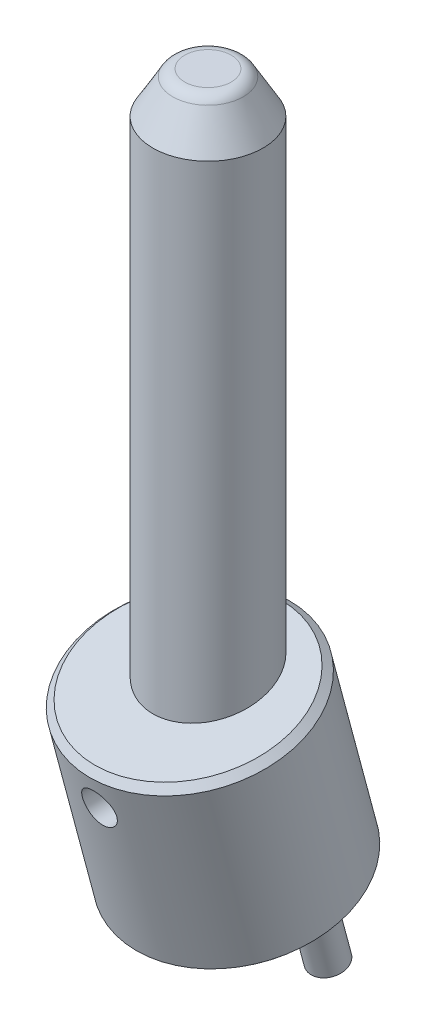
ISO-10303-21;
HEADER;
FILE_DESCRIPTION(('STEP AP214'),'2;1');
FILE_NAME('part.step','',(''),(''),'','','');
FILE_SCHEMA(('AUTOMOTIVE_DESIGN { 1 0 10303 214 1 1 1 1 }'));
ENDSEC;
DATA;
#1=APPLICATION_CONTEXT('core data for automotive mechanical design processes');
#2=APPLICATION_PROTOCOL_DEFINITION('international standard','automotive_design',2000,#1);
#3=PRODUCT_CONTEXT('',#1,'mechanical');
#4=PRODUCT('Part','Part','',(#3));
#5=PRODUCT_RELATED_PRODUCT_CATEGORY('part','',(#4));
#6=PRODUCT_DEFINITION_FORMATION('','',#4);
#7=PRODUCT_DEFINITION_CONTEXT('part definition',#1,'design');
#8=PRODUCT_DEFINITION('design','',#6,#7);
#9=PRODUCT_DEFINITION_SHAPE('','',#8);
#10=(LENGTH_UNIT() NAMED_UNIT(*) SI_UNIT(.MILLI.,.METRE.));
#11=(NAMED_UNIT(*) PLANE_ANGLE_UNIT() SI_UNIT($,.RADIAN.));
#12=(NAMED_UNIT(*) SI_UNIT($,.STERADIAN.) SOLID_ANGLE_UNIT());
#13=UNCERTAINTY_MEASURE_WITH_UNIT(LENGTH_MEASURE(1.E-05),#10,'distance_accuracy_value','');
#14=(GEOMETRIC_REPRESENTATION_CONTEXT(3) GLOBAL_UNCERTAINTY_ASSIGNED_CONTEXT((#13)) GLOBAL_UNIT_ASSIGNED_CONTEXT((#10,
#11,#12)) REPRESENTATION_CONTEXT('',''));
#15=CARTESIAN_POINT('',(0.,0.,0.));
#16=DIRECTION('',(0.,0.,1.));
#17=DIRECTION('',(1.,0.,0.));
#18=AXIS2_PLACEMENT_3D('',#15,#16,#17);
#19=CARTESIAN_POINT('',(0.,99.,0.));
#20=DIRECTION('',(0.,1.,0.));
#21=DIRECTION('',(-1.,0.,0.));
#22=AXIS2_PLACEMENT_3D('',#19,#20,#21);
#23=PLANE('',#22);
#24=CARTESIAN_POINT('',(0.,99.,-3.381197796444));
#25=CARTESIAN_POINT('',(0.0491775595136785,99.,-3.38119852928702));
#26=CARTESIAN_POINT('',(0.0983550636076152,99.,-3.38012493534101));
#27=CARTESIAN_POINT('',(0.196616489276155,99.,-3.37583435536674));
#28=CARTESIAN_POINT('',(0.245700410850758,99.,-3.37261736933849));
#29=CARTESIAN_POINT('',(0.343681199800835,99.,-3.36404526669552));
#30=CARTESIAN_POINT('',(0.392578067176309,99.,-3.35869015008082));
#31=CARTESIAN_POINT('',(0.490091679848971,99.,-3.3458522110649));
#32=CARTESIAN_POINT('',(0.53870842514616,99.,-3.33836938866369));
#33=CARTESIAN_POINT('',(0.635569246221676,99.,-3.321290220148));
#34=CARTESIAN_POINT('',(0.683813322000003,99.,-3.31169387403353));
#35=CARTESIAN_POINT('',(0.77983696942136,99.,-3.29040594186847));
#36=CARTESIAN_POINT('',(0.82761654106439,99.,-3.27871435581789));
#37=CARTESIAN_POINT('',(0.922620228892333,99.,-3.25325819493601));
#38=CARTESIAN_POINT('',(0.969844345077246,99.,-3.23949362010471));
#39=CARTESIAN_POINT('',(1.06364722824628,99.,-3.20991768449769));
#40=CARTESIAN_POINT('',(1.11022599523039,99.,-3.19410632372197));
#41=CARTESIAN_POINT('',(1.202649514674,99.,-3.16046691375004));
#42=CARTESIAN_POINT('',(1.24849426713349,99.,-3.14263886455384));
#43=CARTESIAN_POINT('',(1.33936248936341,99.,-3.10500001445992));
#44=CARTESIAN_POINT('',(1.38438595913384,99.,-3.08518921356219));
#45=CARTESIAN_POINT('',(1.47352591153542,99.,-3.04362257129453));
#46=CARTESIAN_POINT('',(1.51764239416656,99.,-3.02186672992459));
#47=CARTESIAN_POINT('',(1.60488439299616,99.,-2.97645141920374));
#48=CARTESIAN_POINT('',(1.64800990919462,99.,-2.95279194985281));
#49=CARTESIAN_POINT('',(1.73318788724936,99.,-2.90361442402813));
#50=CARTESIAN_POINT('',(1.77524034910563,99.,-2.87809636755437));
#51=CARTESIAN_POINT('',(1.85819215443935,99.,-2.82525022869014));
#52=CARTESIAN_POINT('',(1.89909149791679,98.9999999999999,-2.79792214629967));
#53=CARTESIAN_POINT('',(1.9796592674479,99.0000000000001,-2.74150802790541));
#54=CARTESIAN_POINT('',(2.01932769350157,99.0000000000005,-2.71242199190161));
#55=CARTESIAN_POINT('',(2.09735791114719,98.9999999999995,-2.65254714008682));
#56=CARTESIAN_POINT('',(2.13571970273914,98.9999999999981,-2.62175832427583));
#57=CARTESIAN_POINT('',(2.21106439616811,99.0000000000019,-2.55853724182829));
#58=CARTESIAN_POINT('',(2.24804729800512,99.000000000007,-2.52610497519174));
#59=CARTESIAN_POINT('',(2.32056094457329,98.9999999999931,-2.45965603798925));
#60=CARTESIAN_POINT('',(2.35609168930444,98.999999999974,-2.42563936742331));
#61=CARTESIAN_POINT('',(2.4270521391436,99.000000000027,-2.35468855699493));
#62=CARTESIAN_POINT('',(2.46241950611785,99.0000000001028,-2.3176920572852));
#63=CARTESIAN_POINT('',(2.53146011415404,98.9999999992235,-2.2421494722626));
#64=CARTESIAN_POINT('',(2.56513332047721,98.9999999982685,-2.20360335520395));
#65=CARTESIAN_POINT('',(2.63071590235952,98.9999999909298,-2.12503640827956));
#66=CARTESIAN_POINT('',(2.66262520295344,98.9999999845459,-2.08501551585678));
#67=CARTESIAN_POINT('',(2.72461562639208,98.9999999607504,-2.00357584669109));
#68=CARTESIAN_POINT('',(2.75469663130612,98.9999999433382,-1.962156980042));
#69=CARTESIAN_POINT('',(2.79840512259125,98.9999998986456,-1.89905244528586));
#70=CARTESIAN_POINT('',(2.81273996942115,98.9999998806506,-1.87785353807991));
#71=CARTESIAN_POINT('',(2.84090935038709,98.9999998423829,-1.83514783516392));
#72=CARTESIAN_POINT('',(2.85474423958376,98.9999998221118,-1.81364127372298));
#73=CARTESIAN_POINT('',(2.89548728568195,98.9999997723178,-1.74864245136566));
#74=CARTESIAN_POINT('',(2.92163476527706,98.9999997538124,-1.70466969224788));
#75=CARTESIAN_POINT('',(2.97183520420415,98.9999997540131,-1.61554840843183));
#76=CARTESIAN_POINT('',(2.99588817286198,98.9999997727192,-1.57039988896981));
#77=CARTESIAN_POINT('',(3.04188860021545,98.9999998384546,-1.47904330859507));
#78=CARTESIAN_POINT('',(3.06383620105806,98.999999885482,-1.43283531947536));
#79=CARTESIAN_POINT('',(3.10541271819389,98.9999999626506,-1.33939702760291));
#80=CARTESIAN_POINT('',(3.12504193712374,98.999999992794,-1.29216685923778));
#81=CARTESIAN_POINT('',(3.15291976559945,99.0000000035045,-1.22146858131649));
#82=CARTESIAN_POINT('',(3.1618349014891,99.000000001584,-1.1982567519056));
#83=CARTESIAN_POINT('',(3.19901993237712,98.9999999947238,-1.09818755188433));
#84=CARTESIAN_POINT('',(3.22479363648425,98.9999999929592,-1.02037068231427));
#85=CARTESIAN_POINT('',(3.25883872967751,98.999999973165,-0.903503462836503));
#86=CARTESIAN_POINT('',(3.26930037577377,98.999999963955,-0.865070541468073));
#87=CARTESIAN_POINT('',(3.29035807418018,98.9999999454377,-0.78187483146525));
#88=CARTESIAN_POINT('',(3.30072437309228,98.9999999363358,-0.737052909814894));
#89=CARTESIAN_POINT('',(3.31424558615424,98.9999999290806,-0.672514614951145));
#90=CARTESIAN_POINT('',(3.31816009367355,98.999999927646,-0.652953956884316));
#91=CARTESIAN_POINT('',(3.32632060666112,98.9999999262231,-0.610180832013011));
#92=CARTESIAN_POINT('',(3.33049626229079,98.9999999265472,-0.586954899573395));
#93=CARTESIAN_POINT('',(3.34228609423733,98.9999999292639,-0.517153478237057));
#94=CARTESIAN_POINT('',(3.34916375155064,98.9999999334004,-0.470451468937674));
#95=CARTESIAN_POINT('',(3.36093725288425,98.9999999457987,-0.37680095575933));
#96=CARTESIAN_POINT('',(3.36583314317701,98.9999999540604,-0.329852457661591));
#97=CARTESIAN_POINT('',(3.37363895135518,98.999999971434,-0.235792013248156));
#98=CARTESIAN_POINT('',(3.37654894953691,98.9999999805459,-0.188680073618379));
#99=CARTESIAN_POINT('',(3.38036477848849,98.9999999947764,-0.0943781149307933));
#100=CARTESIAN_POINT('',(3.381270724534,98.9999999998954,-0.0471881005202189));
#101=CARTESIAN_POINT('',(3.38112481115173,99.0000000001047,0.0472251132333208));
#102=CARTESIAN_POINT('',(3.38007141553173,98.9999999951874,0.09444830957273));
#103=CARTESIAN_POINT('',(3.37605062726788,98.9999999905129,0.188811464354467));
#104=CARTESIAN_POINT('',(3.37308329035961,98.9999999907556,0.2359514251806));
#105=CARTESIAN_POINT('',(3.36523468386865,98.9999999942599,0.330073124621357));
#106=CARTESIAN_POINT('',(3.36035337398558,98.9999999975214,0.377054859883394));
#107=CARTESIAN_POINT('',(3.34865879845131,99.0000000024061,0.47078071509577));
#108=CARTESIAN_POINT('',(3.34184539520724,99.000000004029,0.517524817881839));
#109=CARTESIAN_POINT('',(3.33026552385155,98.9999999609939,0.587415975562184));
#110=CARTESIAN_POINT('',(3.3261786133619,98.9999999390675,0.610677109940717));
#111=CARTESIAN_POINT('',(3.32001382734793,98.9999999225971,0.643328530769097));
#112=CARTESIAN_POINT('',(3.31818160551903,98.9999999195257,0.652765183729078));
#113=CARTESIAN_POINT('',(3.30790809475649,98.999999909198,0.704387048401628));
#114=CARTESIAN_POINT('',(3.29862776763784,98.999999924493,0.746407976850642));
#115=CARTESIAN_POINT('',(3.27611885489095,98.9999999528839,0.839847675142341));
#116=CARTESIAN_POINT('',(3.26247449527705,98.9999999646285,0.891165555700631));
#117=CARTESIAN_POINT('',(3.22698341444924,98.9999999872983,1.01297067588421));
#118=CARTESIAN_POINT('',(3.20401224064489,98.9999999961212,1.0831356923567));
#119=CARTESIAN_POINT('',(3.16757440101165,99.0000000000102,1.18334600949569));
#120=CARTESIAN_POINT('',(3.15590283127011,98.9999999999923,1.21405838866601));
#121=CARTESIAN_POINT('',(3.12494638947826,99.000000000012,1.2921679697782));
#122=CARTESIAN_POINT('',(3.10504413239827,99.0000000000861,1.33932320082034));
#123=CARTESIAN_POINT('',(3.06313614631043,98.9999999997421,1.43268851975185));
#124=CARTESIAN_POINT('',(3.04113038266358,98.9999999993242,1.47889859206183));
#125=CARTESIAN_POINT('',(2.9950713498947,98.9999999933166,1.57028914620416));
#126=CARTESIAN_POINT('',(2.97101799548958,98.9999999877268,1.61546958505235));
#127=CARTESIAN_POINT('',(2.92090425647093,98.9999999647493,1.7047092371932));
#128=CARTESIAN_POINT('',(2.89484373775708,98.9999999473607,1.74876837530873));
#129=CARTESIAN_POINT('',(2.85429856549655,98.9999999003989,1.81395013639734));
#130=CARTESIAN_POINT('',(2.84054017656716,98.9999998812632,1.83552759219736));
#131=CARTESIAN_POINT('',(2.81254197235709,98.9999998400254,1.87834577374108));
#132=CARTESIAN_POINT('',(2.7983025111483,98.9999998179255,1.89958673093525));
#133=CARTESIAN_POINT('',(2.75484041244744,98.9999997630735,1.96280026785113));
#134=CARTESIAN_POINT('',(2.72487327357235,98.9999997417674,2.00426478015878));
#135=CARTESIAN_POINT('',(2.6630249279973,98.999999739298,2.08573639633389));
#136=CARTESIAN_POINT('',(2.63114372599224,98.9999997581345,2.12574350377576));
#137=CARTESIAN_POINT('',(2.56557045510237,98.999999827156,2.20424440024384));
#138=CARTESIAN_POINT('',(2.53187851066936,98.9999998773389,2.24273829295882));
#139=CARTESIAN_POINT('',(2.46263073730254,98.9999999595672,2.31799882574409));
#140=CARTESIAN_POINT('',(2.42707516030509,98.9999999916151,2.35476569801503));
#141=CARTESIAN_POINT('',(2.37140677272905,99.0000000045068,2.41027252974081));
#142=CARTESIAN_POINT('',(2.35175738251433,99.0000000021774,2.42948514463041));
#143=CARTESIAN_POINT('',(2.26802085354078,98.9999999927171,2.50941121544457));
#144=CARTESIAN_POINT('',(2.20177871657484,98.9999999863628,2.56792039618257));
#145=CARTESIAN_POINT('',(2.10003782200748,98.9999999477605,2.65091291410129));
#146=CARTESIAN_POINT('',(2.06619123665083,98.9999999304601,2.67746023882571));
#147=CARTESIAN_POINT('',(1.99205588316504,98.9999998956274,2.7333276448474));
#148=CARTESIAN_POINT('',(1.95159525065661,98.9999998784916,2.76242170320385));
#149=CARTESIAN_POINT('',(1.89261855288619,98.9999998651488,2.80284359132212));
#150=CARTESIAN_POINT('',(1.87461413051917,98.9999998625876,2.81492542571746));
#151=CARTESIAN_POINT('',(1.83512217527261,98.9999998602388,2.84086885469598));
#152=CARTESIAN_POINT('',(1.81358901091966,98.9999998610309,2.85466108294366));
#153=CARTESIAN_POINT('',(1.74852510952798,98.9999998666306,2.89529180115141));
#154=CARTESIAN_POINT('',(1.70452676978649,98.999999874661,2.92138652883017));
#155=CARTESIAN_POINT('',(1.61538183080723,98.9999998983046,2.97152713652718));
#156=CARTESIAN_POINT('',(1.57023526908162,98.9999999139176,2.99557308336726));
#157=CARTESIAN_POINT('',(1.47889045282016,98.9999999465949,3.04157160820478));
#158=CARTESIAN_POINT('',(1.43269225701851,98.9999999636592,3.0635243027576));
#159=CARTESIAN_POINT('',(1.33933611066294,98.9999999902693,3.10527343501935));
#160=CARTESIAN_POINT('',(1.29217823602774,98.9999999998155,3.12507004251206));
#161=CARTESIAN_POINT('',(1.20065831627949,99.0000000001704,3.16109559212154));
#162=CARTESIAN_POINT('',(1.15635789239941,98.9999999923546,3.17748154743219));
#163=CARTESIAN_POINT('',(1.06713504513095,98.9999999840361,3.20845589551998));
#164=CARTESIAN_POINT('',(1.02221264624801,98.999999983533,3.22304435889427));
#165=CARTESIAN_POINT('',(0.931813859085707,98.9999999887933,3.25039463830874));
#166=CARTESIAN_POINT('',(0.886337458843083,98.9999999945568,3.26315641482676));
#167=CARTESIAN_POINT('',(0.794895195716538,99.0000000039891,3.28680491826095));
#168=CARTESIAN_POINT('',(0.74892929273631,99.0000000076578,3.29769149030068));
#169=CARTESIAN_POINT('',(0.686121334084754,98.9999999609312,3.31129818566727));
#170=CARTESIAN_POINT('',(0.669443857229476,98.9999999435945,3.31479031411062));
#171=CARTESIAN_POINT('',(0.639370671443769,98.9999999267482,3.32077892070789));
#172=CARTESIAN_POINT('',(0.625986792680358,98.9999999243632,3.32333471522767));
#173=CARTESIAN_POINT('',(0.564781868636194,98.9999999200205,3.33461824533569));
#174=CARTESIAN_POINT('',(0.516772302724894,98.9999999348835,3.34234416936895));
#175=CARTESIAN_POINT('',(0.428809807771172,98.9999999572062,3.35455837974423));
#176=CARTESIAN_POINT('',(0.388901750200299,98.9999999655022,3.35937566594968));
#177=CARTESIAN_POINT('',(0.315880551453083,98.9999999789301,3.36686744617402));
#178=CARTESIAN_POINT('',(0.28279046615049,98.9999999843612,3.36976874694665));
#179=CARTESIAN_POINT('',(0.198641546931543,98.9999999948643,3.37590123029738));
#180=CARTESIAN_POINT('',(0.147531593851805,98.9999999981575,3.37846406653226));
#181=CARTESIAN_POINT('',(0.0775593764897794,98.9999999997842,3.38039422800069));
#182=CARTESIAN_POINT('',(0.0587195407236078,98.9999999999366,3.38075747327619));
#183=CARTESIAN_POINT('',(0.0265859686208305,99.0000000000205,3.38112029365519));
#184=CARTESIAN_POINT('',(0.0132930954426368,99.0000000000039,3.38119547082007));
#185=CARTESIAN_POINT('',(0.,99.,3.381197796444));
#186=B_SPLINE_CURVE_WITH_KNOTS('',3,(#24,#25,#26,#27,#28,#29,#30,#31,#32,#33,#34,#35,#36,#37,
#38,#39,#40,#41,#42,#43,#44,#45,#46,#47,#48,#49,#50,#51,#52,#53,#54,#55,#56,#57,#58,#59,#60,#61,
#62,#63,#64,#65,#66,#67,#68,#69,#70,#71,#72,#73,#74,#75,#76,#77,#78,#79,#80,#81,#82,#83,#84,#85,
#86,#87,#88,#89,#90,#91,#92,#93,#94,#95,#96,#97,#98,#99,#100,#101,#102,#103,#104,#105,#106,#107,
#108,#109,#110,#111,#112,#113,#114,#115,#116,#117,#118,#119,#120,#121,#122,#123,#124,#125,#126,
#127,#128,#129,#130,#131,#132,#133,#134,#135,#136,#137,#138,#139,#140,#141,#142,#143,#144,#145,
#146,#147,#148,#149,#150,#151,#152,#153,#154,#155,#156,#157,#158,#159,#160,#161,#162,#163,#164,
#165,#166,#167,#168,#169,#170,#171,#172,#173,#174,#175,#176,#177,#178,#179,#180,#181,#182,#183,
#184,#185),.UNSPECIFIED.,.F.,.F.,(4,2,2,2,2,2,2,2,2,2,2,2,2,2,2,2,2,2,2,2,2,2,2,2,2,2,2,2,2,2,2,
2,2,2,2,2,2,2,2,2,2,2,2,2,2,2,2,2,2,2,2,2,2,2,2,2,2,2,2,2,2,2,2,2,2,2,2,2,2,2,2,2,2,2,2,2,2,2,2,
2,4),(0.,0.147520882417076,0.295041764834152,0.442562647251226,0.590083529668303,
0.737604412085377,0.885125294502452,1.03264617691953,1.18016705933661,1.32768794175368,
1.47520882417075,1.62272970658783,1.77025058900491,1.91777147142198,2.06529235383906,
2.21281323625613,2.36033411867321,2.50785500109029,2.65537588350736,2.80886971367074,
2.96236668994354,3.11587018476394,3.26938357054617,3.34614986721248,3.42286052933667,
3.57627689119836,3.72969256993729,3.88309788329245,4.03648314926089,4.11107818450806,
4.35672731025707,4.47620511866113,4.61417295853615,4.67401611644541,4.7448062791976,
4.88637772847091,5.02794587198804,5.16950829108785,5.31106256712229,5.45272787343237,
5.59438905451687,5.73605321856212,5.87772747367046,5.94857428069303,5.9774125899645,
6.106474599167,6.26572562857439,6.48702972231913,6.58558754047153,6.73908101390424,
6.89257701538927,7.04607941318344,7.19959207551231,7.27635829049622,7.3530691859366,
7.50648650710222,7.65990345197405,7.81330986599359,7.96669559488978,8.04913919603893,
8.3139440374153,8.4429705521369,8.59241517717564,8.65745956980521,8.73416806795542,
8.88757343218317,9.04097379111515,9.19436560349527,9.34774532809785,9.48940809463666,
9.6310652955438,9.77272556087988,9.91439752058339,9.9655130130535,10.006389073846,
10.152216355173,10.2727850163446,10.3724238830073,10.5258841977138,10.5824125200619,
10.6222911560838),.UNSPECIFIED.);
#187=CARTESIAN_POINT('',(0.,99.,-3.3811978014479));
#188=VERTEX_POINT('',#187);
#189=CARTESIAN_POINT('',(0.,99.,3.3811978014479));
#190=VERTEX_POINT('',#189);
#191=EDGE_CURVE('P0_E38',#188,#190,#186,.T.);
#192=ORIENTED_EDGE('',*,*,#191,.F.);
#193=CARTESIAN_POINT('',(0.,99.,0.));
#194=DIRECTION('',(0.,-1.,0.));
#195=DIRECTION('',(0.,0.,1.));
#196=AXIS2_PLACEMENT_3D('',#193,#194,#195);
#197=CIRCLE('',#196,3.381197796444);
#198=EDGE_CURVE('P0_E42',#190,#188,#197,.T.);
#199=ORIENTED_EDGE('',*,*,#198,.F.);
#200=EDGE_LOOP('',(#192,#199));
#201=FACE_BOUND('',#200,.T.);
#202=ADVANCED_FACE('P0_F17',(#201),#23,.T.);
#203=CARTESIAN_POINT('',(0.,97.,0.));
#204=DIRECTION('',(0.,1.,0.));
#205=DIRECTION('',(0.0117940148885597,0.,0.999930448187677));
#206=AXIS2_PLACEMENT_3D('',#203,#204,#205);
#207=TOROIDAL_SURFACE('',#206,3.381197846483,2.);
#208=ORIENTED_EDGE('',*,*,#191,.T.);
#209=ORIENTED_EDGE('',*,*,#198,.T.);
#210=EDGE_LOOP('',(#208,#209));
#211=FACE_BOUND('',#210,.T.);
#212=CARTESIAN_POINT('',(0.,98.0000000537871,0.));
#213=DIRECTION('',(0.,-1.,0.));
#214=DIRECTION('',(0.,0.,1.));
#215=AXIS2_PLACEMENT_3D('',#212,#213,#214);
#216=CIRCLE('',#215,5.11324862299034);
#217=CARTESIAN_POINT('',(0.,98.0000000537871,5.11324862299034));
#218=VERTEX_POINT('',#217);
#219=EDGE_CURVE('P0_E48',#218,#218,#216,.T.);
#220=ORIENTED_EDGE('',*,*,#219,.F.);
#221=EDGE_LOOP('',(#220));
#222=FACE_BOUND('',#221,.T.);
#223=ADVANCED_FACE('P0_F40',(#211,#222),#207,.T.);
#224=CARTESIAN_POINT('',(0.,0.,0.));
#225=DIRECTION('',(0.,1.,0.));
#226=DIRECTION('',(-1.,0.,0.));
#227=AXIS2_PLACEMENT_3D('',#224,#225,#226);
#228=PLANE('',#227);
#229=CARTESIAN_POINT('',(0.,6.2631058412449E-07,0.));
#230=DIRECTION('',(0.,1.,0.));
#231=DIRECTION('',(-1.,0.,0.));
#232=AXIS2_PLACEMENT_3D('',#229,#230,#231);
#233=CIRCLE('',#232,6.99999848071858);
#234=CARTESIAN_POINT('',(-6.99999848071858,6.26310584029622E-07,0.));
#235=VERTEX_POINT('',#234);
#236=EDGE_CURVE('P0_E85',#235,#235,#233,.T.);
#237=ORIENTED_EDGE('',*,*,#236,.F.);
#238=EDGE_LOOP('',(#237));
#239=FACE_BOUND('',#238,.T.);
#240=ADVANCED_FACE('P0_F76',(#239),#228,.F.);
#241=CARTESIAN_POINT('',(0.,14.,2.94337567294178));
#242=DIRECTION('',(0.,0.,1.));
#243=DIRECTION('',(0.,-1.,0.));
#244=AXIS2_PLACEMENT_3D('',#241,#242,#243);
#245=CONICAL_SURFACE('',#244,2.50000000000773,1.04719755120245);
#246=CARTESIAN_POINT('',(0.,14.0000000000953,1.49999999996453));
#247=VERTEX_POINT('',#246);
#248=VERTEX_LOOP('',#247);
#249=FACE_BOUND('',#248,.T.);
#250=CARTESIAN_POINT('',(0.,14.,2.943375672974));
#251=DIRECTION('',(0.,0.,1.));
#252=DIRECTION('',(0.,-1.,0.));
#253=AXIS2_PLACEMENT_3D('',#250,#251,#252);
#254=CIRCLE('',#253,2.5);
#255=CARTESIAN_POINT('',(0.,11.5,2.943375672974));
#256=VERTEX_POINT('',#255);
#257=EDGE_CURVE('P0_E82',#256,#256,#254,.T.);
#258=ORIENTED_EDGE('',*,*,#257,.T.);
#259=EDGE_LOOP('',(#258));
#260=FACE_BOUND('',#259,.T.);
#261=ADVANCED_FACE('P0_F116',(#249,#260),#245,.F.);
#262=CARTESIAN_POINT('',(0.,93.0000000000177,0.));
#263=DIRECTION('',(0.,-1.,0.));
#264=DIRECTION('',(1.,0.,0.));
#265=AXIS2_PLACEMENT_3D('',#262,#263,#264);
#266=CONICAL_SURFACE('',#265,7.99999999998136,0.523598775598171);
#267=CARTESIAN_POINT('',(0.,93.,0.));
#268=DIRECTION('',(0.,1.,0.));
#269=DIRECTION('',(-1.,0.,0.));
#270=AXIS2_PLACEMENT_3D('',#267,#268,#269);
#271=CIRCLE('',#270,8.);
#272=CARTESIAN_POINT('',(-8.,93.,0.));
#273=VERTEX_POINT('',#272);
#274=EDGE_CURVE('P0_E92',#273,#273,#271,.F.);
#275=ORIENTED_EDGE('',*,*,#274,.F.);
#276=EDGE_LOOP('',(#275));
#277=FACE_BOUND('',#276,.T.);
#278=ORIENTED_EDGE('',*,*,#219,.T.);
#279=EDGE_LOOP('',(#278));
#280=FACE_BOUND('',#279,.T.);
#281=ADVANCED_FACE('P0_F108',(#277,#280),#266,.T.);
#282=CARTESIAN_POINT('',(0.,1.00000173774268,0.));
#283=DIRECTION('',(0.,1.,0.));
#284=DIRECTION('',(-1.,0.,0.));
#285=AXIS2_PLACEMENT_3D('',#282,#283,#284);
#286=CONICAL_SURFACE('',#285,7.9999992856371,0.785398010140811);
#287=CARTESIAN_POINT('',(0.,1.00000102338,0.));
#288=DIRECTION('',(0.,1.,0.));
#289=DIRECTION('',(-1.,0.,0.));
#290=AXIS2_PLACEMENT_3D('',#287,#288,#289);
#291=CIRCLE('',#290,8.);
#292=CARTESIAN_POINT('',(-8.,1.00000102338,0.));
#293=VERTEX_POINT('',#292);
#294=EDGE_CURVE('P0_E28',#293,#293,#291,.T.);
#295=ORIENTED_EDGE('',*,*,#294,.F.);
#296=EDGE_LOOP('',(#295));
#297=FACE_BOUND('',#296,.T.);
#298=ORIENTED_EDGE('',*,*,#236,.T.);
#299=EDGE_LOOP('',(#298));
#300=FACE_BOUND('',#299,.T.);
#301=ADVANCED_FACE('P0_F105',(#297,#300),#286,.T.);
#302=CARTESIAN_POINT('',(0.,14.,1.075));
#303=DIRECTION('',(0.,0.,1.));
#304=DIRECTION('',(0.,-1.,0.));
#305=AXIS2_PLACEMENT_3D('',#302,#303,#304);
#306=CYLINDRICAL_SURFACE('',#305,2.5);
#307=ORIENTED_EDGE('',*,*,#257,.F.);
#308=EDGE_LOOP('',(#307));
#309=FACE_BOUND('',#308,.T.);
#310=CARTESIAN_POINT('',(0.,11.5,8.));
#311=CARTESIAN_POINT('',(-0.136696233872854,11.5000075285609,7.99999486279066));
#312=CARTESIAN_POINT('',(-0.273538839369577,11.5112631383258,7.99645812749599));
#313=CARTESIAN_POINT('',(-0.543359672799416,11.5559205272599,7.98267442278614));
#314=CARTESIAN_POINT('',(-0.676330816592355,11.589360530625,7.97241587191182));
#315=CARTESIAN_POINT('',(-0.934271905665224,11.6771461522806,7.94631394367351));
#316=CARTESIAN_POINT('',(-1.05925832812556,11.7314469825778,7.93048253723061));
#317=CARTESIAN_POINT('',(-1.2983071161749,11.8592577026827,7.89487323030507));
#318=CARTESIAN_POINT('',(-1.4123711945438,11.9327645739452,7.87509595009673));
#319=CARTESIAN_POINT('',(-1.62992724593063,12.0993097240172,7.83300483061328));
#320=CARTESIAN_POINT('',(-1.73303436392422,12.1928367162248,7.81063552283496));
#321=CARTESIAN_POINT('',(-1.92239021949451,12.3957308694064,7.76620212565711));
#322=CARTESIAN_POINT('',(-2.00863490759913,12.5051018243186,7.74413811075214));
#323=CARTESIAN_POINT('',(-2.16388692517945,12.7398894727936,7.70222283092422));
#324=CARTESIAN_POINT('',(-2.23241606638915,12.8656356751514,7.6824396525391));
#325=CARTESIAN_POINT('',(-2.34719509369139,13.1275854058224,7.64815595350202));
#326=CARTESIAN_POINT('',(-2.3934509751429,13.2637861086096,7.6336540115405));
#327=CARTESIAN_POINT('',(-2.4609691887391,13.5384561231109,7.61215214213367));
#328=CARTESIAN_POINT('',(-2.48294218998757,13.6767336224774,7.60493946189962));
#329=CARTESIAN_POINT('',(-2.50349110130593,13.9551861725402,7.59820110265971));
#330=CARTESIAN_POINT('',(-2.50207322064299,14.0953607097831,7.59867338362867));
#331=CARTESIAN_POINT('',(-2.47643652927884,14.3677485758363,7.60706377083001));
#332=CARTESIAN_POINT('',(-2.45312128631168,14.5000575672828,7.61468679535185));
#333=CARTESIAN_POINT('',(-2.38581648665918,14.7587836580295,7.63604044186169));
#334=CARTESIAN_POINT('',(-2.34182462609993,14.8852000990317,7.64977174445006));
#335=CARTESIAN_POINT('',(-2.23377596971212,15.1307074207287,7.68202134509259));
#336=CARTESIAN_POINT('',(-2.16943495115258,15.2496640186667,7.7006067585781));
#337=CARTESIAN_POINT('',(-2.02271557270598,15.4753816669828,7.74043834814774));
#338=CARTESIAN_POINT('',(-1.94033355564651,15.5821402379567,7.76168506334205));
#339=CARTESIAN_POINT('',(-1.75545127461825,15.7855312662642,7.80562654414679));
#340=CARTESIAN_POINT('',(-1.65220788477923,15.8814846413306,7.82834327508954));
#341=CARTESIAN_POINT('',(-1.43076939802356,16.0549161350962,7.87182395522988));
#342=CARTESIAN_POINT('',(-1.31256787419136,16.1323862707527,7.8925870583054));
#343=CARTESIAN_POINT('',(-1.06322528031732,16.2671146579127,7.93004255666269));
#344=CARTESIAN_POINT('',(-0.931982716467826,16.3241954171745,7.94669883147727));
#345=CARTESIAN_POINT('',(-0.661263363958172,16.4151681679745,7.97377752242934));
#346=CARTESIAN_POINT('',(-0.521804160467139,16.4491078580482,7.98421275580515));
#347=CARTESIAN_POINT('',(-0.317572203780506,16.4805676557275,7.9939447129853));
#348=CARTESIAN_POINT('',(-0.25430866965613,16.4878463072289,7.99620897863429));
#349=CARTESIAN_POINT('',(-0.127374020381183,16.4975642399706,7.99923782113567));
#350=CARTESIAN_POINT('',(-0.0637029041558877,16.5000035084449,8.000002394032));
#351=CARTESIAN_POINT('',(0.13669623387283,16.4999924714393,7.99999486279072));
#352=CARTESIAN_POINT('',(0.273538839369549,16.4887368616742,7.996458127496));
#353=CARTESIAN_POINT('',(0.543359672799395,16.4440794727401,7.98267442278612));
#354=CARTESIAN_POINT('',(0.676330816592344,16.410639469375,7.97241587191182));
#355=CARTESIAN_POINT('',(0.934271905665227,16.3228538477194,7.94631394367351));
#356=CARTESIAN_POINT('',(1.05925832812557,16.2685530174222,7.93048253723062));
#357=CARTESIAN_POINT('',(1.2983071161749,16.1407422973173,7.89487323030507));
#358=CARTESIAN_POINT('',(1.4123711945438,16.0672354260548,7.87509595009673));
#359=CARTESIAN_POINT('',(1.62992724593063,15.9006902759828,7.83300483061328));
#360=CARTESIAN_POINT('',(1.73303436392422,15.8071632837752,7.81063552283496));
#361=CARTESIAN_POINT('',(1.92239021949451,15.6042691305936,7.76620212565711));
#362=CARTESIAN_POINT('',(2.00863490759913,15.4948981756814,7.74413811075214));
#363=CARTESIAN_POINT('',(2.16388692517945,15.2601105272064,7.70222283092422));
#364=CARTESIAN_POINT('',(2.23241606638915,15.1343643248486,7.6824396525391));
#365=CARTESIAN_POINT('',(2.34719509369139,14.8724145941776,7.64815595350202));
#366=CARTESIAN_POINT('',(2.3934509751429,14.7362138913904,7.6336540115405));
#367=CARTESIAN_POINT('',(2.4609691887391,14.4615438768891,7.61215214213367));
#368=CARTESIAN_POINT('',(2.48294218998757,14.3232663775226,7.60493946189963));
#369=CARTESIAN_POINT('',(2.50349110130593,14.0448138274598,7.59820110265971));
#370=CARTESIAN_POINT('',(2.50207322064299,13.9046392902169,7.59867338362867));
#371=CARTESIAN_POINT('',(2.47643652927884,13.6322514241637,7.60706377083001));
#372=CARTESIAN_POINT('',(2.45312128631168,13.4999424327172,7.61468679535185));
#373=CARTESIAN_POINT('',(2.38581648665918,13.2412163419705,7.63604044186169));
#374=CARTESIAN_POINT('',(2.34182462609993,13.1147999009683,7.64977174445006));
#375=CARTESIAN_POINT('',(2.23377596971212,12.8692925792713,7.68202134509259));
#376=CARTESIAN_POINT('',(2.16943495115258,12.7503359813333,7.7006067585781));
#377=CARTESIAN_POINT('',(2.02271557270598,12.5246183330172,7.74043834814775));
#378=CARTESIAN_POINT('',(1.94033355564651,12.4178597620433,7.76168506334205));
#379=CARTESIAN_POINT('',(1.75545127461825,12.2144687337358,7.80562654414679));
#380=CARTESIAN_POINT('',(1.65220788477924,12.1185153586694,7.82834327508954));
#381=CARTESIAN_POINT('',(1.43076939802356,11.9450838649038,7.87182395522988));
#382=CARTESIAN_POINT('',(1.31256787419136,11.8676137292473,7.8925870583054));
#383=CARTESIAN_POINT('',(1.06322528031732,11.7328853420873,7.93004255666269));
#384=CARTESIAN_POINT('',(0.931982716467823,11.6758045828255,7.94669883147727));
#385=CARTESIAN_POINT('',(0.661263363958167,11.5848318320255,7.97377752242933));
#386=CARTESIAN_POINT('',(0.521804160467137,11.5508921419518,7.98421275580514));
#387=CARTESIAN_POINT('',(0.317572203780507,11.5194323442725,7.9939447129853));
#388=CARTESIAN_POINT('',(0.254308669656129,11.512153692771,7.9962089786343));
#389=CARTESIAN_POINT('',(0.127374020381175,11.5024357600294,7.99923782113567));
#390=CARTESIAN_POINT('',(0.0637029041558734,11.4999964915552,8.00000239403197));
#391=CARTESIAN_POINT('',(0.,11.5,8.));
#392=B_SPLINE_CURVE_WITH_KNOTS('',3,(#310,#311,#312,#313,#314,#315,#316,#317,#318,#319,#320,
#321,#322,#323,#324,#325,#326,#327,#328,#329,#330,#331,#332,#333,#334,#335,#336,#337,#338,#339,
#340,#341,#342,#343,#344,#345,#346,#347,#348,#349,#350,#351,#352,#353,#354,#355,#356,#357,#358,
#359,#360,#361,#362,#363,#364,#365,#366,#367,#368,#369,#370,#371,#372,#373,#374,#375,#376,#377,
#378,#379,#380,#381,#382,#383,#384,#385,#386,#387,#388,#389,#390,#391),.UNSPECIFIED.,.T.,.F.,(4,
2,2,2,2,2,2,2,2,2,2,2,2,2,2,2,2,2,2,2,2,2,2,2,2,2,2,2,2,2,2,2,2,2,2,2,2,2,2,2,4),(0.,
0.409843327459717,0.820394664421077,1.23006943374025,1.6396798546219,2.06074511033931,
2.48191136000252,2.91347666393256,3.34492573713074,3.76338291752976,4.18172901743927,
4.58353732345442,4.98539041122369,5.39312450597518,5.80094133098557,6.22725884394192,
6.65376015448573,7.08388858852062,7.51312773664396,7.70412159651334,7.89511596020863,
8.30495928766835,8.71551062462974,9.12518539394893,9.53479581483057,9.95586107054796,
10.3770273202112,10.8085926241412,11.2400416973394,11.6584988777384,12.0768449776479,
12.4786532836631,12.8805063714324,13.2882404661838,13.6960572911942,14.1223748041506,
14.5488761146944,14.9790045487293,15.4082436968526,15.599237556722,15.7902319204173),.UNSPECIFIED.);
#393=CARTESIAN_POINT('',(0.,11.5,8.));
#394=VERTEX_POINT('',#393);
#395=EDGE_CURVE('P0_E11',#394,#394,#392,.T.);
#396=ORIENTED_EDGE('',*,*,#395,.F.);
#397=EDGE_LOOP('',(#396));
#398=FACE_BOUND('',#397,.T.);
#399=ADVANCED_FACE('P0_F107',(#309,#398),#306,.F.);
#400=CARTESIAN_POINT('',(0.,-4.95,0.));
#401=DIRECTION('',(0.,1.,0.));
#402=DIRECTION('',(-1.,0.,0.));
#403=AXIS2_PLACEMENT_3D('',#400,#401,#402);
#404=CYLINDRICAL_SURFACE('',#403,8.);
#405=ORIENTED_EDGE('',*,*,#274,.T.);
#406=EDGE_LOOP('',(#405));
#407=FACE_BOUND('',#406,.T.);
#408=ORIENTED_EDGE('',*,*,#294,.T.);
#409=EDGE_LOOP('',(#408));
#410=FACE_BOUND('',#409,.T.);
#411=ORIENTED_EDGE('',*,*,#395,.T.);
#412=EDGE_LOOP('',(#411));
#413=FACE_BOUND('',#412,.T.);
#414=ADVANCED_FACE('P0_F102',(#407,#410,#413),#404,.T.);
#415=CLOSED_SHELL('',(#202,#223,#240,#261,#281,#301,#399,#414));
#416=MANIFOLD_SOLID_BREP('P0_B1',#415);
#417=CARTESIAN_POINT('',(0.,-11.0668239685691,-6.2902986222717));
#418=DIRECTION('',(0.,-0.965925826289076,-0.258819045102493));
#419=DIRECTION('',(0.,0.258819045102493,-0.965925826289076));
#420=AXIS2_PLACEMENT_3D('',#417,#418,#419);
#421=PLANE('',#420);
#422=CARTESIAN_POINT('',(-11.25,-11.0668239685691,-6.2902986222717));
#423=DIRECTION('',(0.,-0.965925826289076,-0.258819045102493));
#424=DIRECTION('',(0.,0.258819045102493,-0.965925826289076));
#425=AXIS2_PLACEMENT_3D('',#422,#423,#424);
#426=CIRCLE('',#425,1.9999654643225);
#427=CARTESIAN_POINT('',(-11.25,-10.5491948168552,-8.22211691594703));
#428=VERTEX_POINT('',#427);
#429=EDGE_CURVE('P1_E17',#428,#428,#426,.F.);
#430=ORIENTED_EDGE('',*,*,#429,.F.);
#431=EDGE_LOOP('',(#430));
#432=FACE_BOUND('',#431,.T.);
#433=ADVANCED_FACE('P1_F14',(#432),#421,.T.);
#434=CARTESIAN_POINT('',(0.,-11.0668239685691,-6.2902986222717));
#435=DIRECTION('',(0.,-0.965925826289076,-0.258819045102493));
#436=DIRECTION('',(0.,0.258819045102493,-0.965925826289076));
#437=AXIS2_PLACEMENT_3D('',#434,#435,#436);
#438=PLANE('',#437);
#439=CARTESIAN_POINT('',(11.25,-11.0668239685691,-6.2902986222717));
#440=DIRECTION('',(0.,-0.965925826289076,-0.258819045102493));
#441=DIRECTION('',(0.,0.258819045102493,-0.965925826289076));
#442=AXIS2_PLACEMENT_3D('',#439,#440,#441);
#443=CIRCLE('',#442,1.99996546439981);
#444=CARTESIAN_POINT('',(11.25,-10.5491948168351,-8.2221169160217));
#445=VERTEX_POINT('',#444);
#446=EDGE_CURVE('P1_E114',#445,#445,#443,.F.);
#447=ORIENTED_EDGE('',*,*,#446,.F.);
#448=EDGE_LOOP('',(#447));
#449=FACE_BOUND('',#448,.T.);
#450=ADVANCED_FACE('P1_F104',(#449),#438,.T.);
#451=CARTESIAN_POINT('',(0.,3.78169717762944E-13,-3.05311331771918E-13));
#452=DIRECTION('',(0.,-1.,0.));
#453=DIRECTION('',(0.,0.,-1.));
#454=AXIS2_PLACEMENT_3D('',#451,#452,#453);
#455=PLANE('',#454);
#456=CARTESIAN_POINT('',(0.,1.43982048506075E-13,-2.60208521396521E-13));
#457=DIRECTION('',(0.,-1.,0.));
#458=DIRECTION('',(0.,0.,-1.));
#459=AXIS2_PLACEMENT_3D('',#456,#457,#458);
#460=CIRCLE('',#459,8.);
#461=CARTESIAN_POINT('',(0.,1.43982048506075E-13,-8.00000000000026));
#462=VERTEX_POINT('',#461);
#463=EDGE_CURVE('P1_E116',#462,#462,#460,.F.);
#464=ORIENTED_EDGE('',*,*,#463,.T.);
#465=EDGE_LOOP('',(#464));
#466=FACE_BOUND('',#465,.T.);
#467=ADVANCED_FACE('P1_F101',(#466),#455,.F.);
#468=CARTESIAN_POINT('',(-11.25,-10.5838375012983,-6.16088278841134));
#469=DIRECTION('',(0.,0.965925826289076,0.258819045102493));
#470=DIRECTION('',(0.,-0.258819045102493,0.965925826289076));
#471=AXIS2_PLACEMENT_3D('',#468,#469,#470);
#472=CONICAL_SURFACE('',#471,2.49998121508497,0.78538952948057);
#473=CARTESIAN_POINT('',(-11.25,-10.5838193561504,-6.16087792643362));
#474=DIRECTION('',(0.,0.965925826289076,0.258819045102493));
#475=DIRECTION('',(0.,-0.258819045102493,0.965925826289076));
#476=AXIS2_PLACEMENT_3D('',#473,#474,#475);
#477=CIRCLE('',#476,2.5);
#478=CARTESIAN_POINT('',(-11.25,-11.2308669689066,-3.74606336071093));
#479=VERTEX_POINT('',#478);
#480=EDGE_CURVE('P1_E118',#479,#479,#477,.T.);
#481=ORIENTED_EDGE('',*,*,#480,.F.);
#482=EDGE_LOOP('',(#481));
#483=FACE_BOUND('',#482,.T.);
#484=ORIENTED_EDGE('',*,*,#429,.T.);
#485=EDGE_LOOP('',(#484));
#486=FACE_BOUND('',#485,.T.);
#487=ADVANCED_FACE('P1_F97',(#483,#486),#472,.T.);
#488=CARTESIAN_POINT('',(11.25,-10.5838375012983,-6.16088278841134));
#489=DIRECTION('',(0.,0.965925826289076,0.258819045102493));
#490=DIRECTION('',(0.,-0.258819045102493,0.965925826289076));
#491=AXIS2_PLACEMENT_3D('',#488,#489,#490);
#492=CONICAL_SURFACE('',#491,2.49998121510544,0.785389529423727);
#493=CARTESIAN_POINT('',(11.25,-10.5838193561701,-6.16087792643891));
#494=DIRECTION('',(0.,0.965925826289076,0.258819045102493));
#495=DIRECTION('',(0.,-0.258819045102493,0.965925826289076));
#496=AXIS2_PLACEMENT_3D('',#493,#494,#495);
#497=CIRCLE('',#496,2.5);
#498=CARTESIAN_POINT('',(11.25,-11.2308669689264,-3.74606336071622));
#499=VERTEX_POINT('',#498);
#500=EDGE_CURVE('P1_E123',#499,#499,#497,.T.);
#501=ORIENTED_EDGE('',*,*,#500,.F.);
#502=EDGE_LOOP('',(#501));
#503=FACE_BOUND('',#502,.T.);
#504=ORIENTED_EDGE('',*,*,#446,.T.);
#505=EDGE_LOOP('',(#504));
#506=FACE_BOUND('',#505,.T.);
#507=ADVANCED_FACE('P1_F92',(#503,#506),#492,.T.);
#508=CARTESIAN_POINT('',(0.,37.9000000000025,-2.60208521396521E-13));
#509=DIRECTION('',(0.,-1.,0.));
#510=DIRECTION('',(0.,0.,-1.));
#511=AXIS2_PLACEMENT_3D('',#508,#509,#510);
#512=CYLINDRICAL_SURFACE('',#511,8.);
#513=CARTESIAN_POINT('',(0.,24.0000000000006,-2.60208521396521E-13));
#514=DIRECTION('',(0.,0.965925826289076,0.258819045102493));
#515=DIRECTION('',(0.,-0.258819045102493,0.965925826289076));
#516=AXIS2_PLACEMENT_3D('',#513,#514,#515);
#517=ELLIPSE('',#516,8.2822094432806,8.);
#518=CARTESIAN_POINT('',(0.,21.8564064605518,7.99999999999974));
#519=VERTEX_POINT('',#518);
#520=EDGE_CURVE('P1_E79',#519,#519,#517,.F.);
#521=ORIENTED_EDGE('',*,*,#520,.F.);
#522=EDGE_LOOP('',(#521));
#523=FACE_BOUND('',#522,.T.);
#524=ORIENTED_EDGE('',*,*,#463,.F.);
#525=EDGE_LOOP('',(#524));
#526=FACE_BOUND('',#525,.T.);
#527=CARTESIAN_POINT('',(0.,16.5000000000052,7.99999999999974));
#528=CARTESIAN_POINT('',(-0.136696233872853,16.4999924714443,7.9999948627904));
#529=CARTESIAN_POINT('',(-0.273538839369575,16.4887368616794,7.99645812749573));
#530=CARTESIAN_POINT('',(-0.543359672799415,16.4440794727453,7.98267442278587));
#531=CARTESIAN_POINT('',(-0.676330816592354,16.4106394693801,7.97241587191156));
#532=CARTESIAN_POINT('',(-0.934271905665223,16.3228538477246,7.94631394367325));
#533=CARTESIAN_POINT('',(-1.05925832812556,16.2685530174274,7.93048253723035));
#534=CARTESIAN_POINT('',(-1.2983071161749,16.1407422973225,7.89487323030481));
#535=CARTESIAN_POINT('',(-1.4123711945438,16.06723542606,7.87509595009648));
#536=CARTESIAN_POINT('',(-1.62992724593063,15.900690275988,7.83300483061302));
#537=CARTESIAN_POINT('',(-1.73303436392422,15.8071632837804,7.8106355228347));
#538=CARTESIAN_POINT('',(-1.92239021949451,15.6042691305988,7.76620212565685));
#539=CARTESIAN_POINT('',(-2.00863490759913,15.4948981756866,7.74413811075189));
#540=CARTESIAN_POINT('',(-2.16388692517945,15.2601105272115,7.70222283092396));
#541=CARTESIAN_POINT('',(-2.23241606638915,15.1343643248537,7.68243965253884));
#542=CARTESIAN_POINT('',(-2.34719509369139,14.8724145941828,7.64815595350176));
#543=CARTESIAN_POINT('',(-2.3934509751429,14.7362138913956,7.63365401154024));
#544=CARTESIAN_POINT('',(-2.4609691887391,14.4615438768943,7.61215214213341));
#545=CARTESIAN_POINT('',(-2.48294218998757,14.3232663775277,7.60493946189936));
#546=CARTESIAN_POINT('',(-2.50349110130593,14.0448138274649,7.59820110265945));
#547=CARTESIAN_POINT('',(-2.50207322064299,13.9046392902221,7.59867338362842));
#548=CARTESIAN_POINT('',(-2.47643652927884,13.6322514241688,7.60706377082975));
#549=CARTESIAN_POINT('',(-2.45312128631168,13.4999424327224,7.61468679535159));
#550=CARTESIAN_POINT('',(-2.38581648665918,13.2412163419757,7.63604044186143));
#551=CARTESIAN_POINT('',(-2.34182462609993,13.1147999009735,7.6497717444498));
#552=CARTESIAN_POINT('',(-2.23377596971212,12.8692925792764,7.68202134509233));
#553=CARTESIAN_POINT('',(-2.16943495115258,12.7503359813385,7.70060675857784));
#554=CARTESIAN_POINT('',(-2.02271557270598,12.5246183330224,7.74043834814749));
#555=CARTESIAN_POINT('',(-1.94033355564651,12.4178597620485,7.76168506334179));
#556=CARTESIAN_POINT('',(-1.75545127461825,12.214468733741,7.80562654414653));
#557=CARTESIAN_POINT('',(-1.65220788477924,12.1185153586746,7.82834327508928));
#558=CARTESIAN_POINT('',(-1.43076939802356,11.945083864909,7.87182395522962));
#559=CARTESIAN_POINT('',(-1.31256787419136,11.8676137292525,7.89258705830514));
#560=CARTESIAN_POINT('',(-1.06322528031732,11.7328853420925,7.93004255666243));
#561=CARTESIAN_POINT('',(-0.931982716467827,11.6758045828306,7.94669883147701));
#562=CARTESIAN_POINT('',(-0.661263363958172,11.5848318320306,7.97377752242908));
#563=CARTESIAN_POINT('',(-0.521804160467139,11.550892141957,7.98421275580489));
#564=CARTESIAN_POINT('',(-0.317572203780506,11.5194323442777,7.99394471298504));
#565=CARTESIAN_POINT('',(-0.25430866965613,11.5121536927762,7.99620897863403));
#566=CARTESIAN_POINT('',(-0.127374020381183,11.5024357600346,7.99923782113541));
#567=CARTESIAN_POINT('',(-0.0637029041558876,11.4999964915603,8.00000239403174));
#568=CARTESIAN_POINT('',(0.13669623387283,11.5000075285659,7.99999486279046));
#569=CARTESIAN_POINT('',(0.273538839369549,11.5112631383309,7.99645812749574));
#570=CARTESIAN_POINT('',(0.543359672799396,11.5559205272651,7.98267442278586));
#571=CARTESIAN_POINT('',(0.676330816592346,11.5893605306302,7.97241587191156));
#572=CARTESIAN_POINT('',(0.934271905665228,11.6771461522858,7.94631394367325));
#573=CARTESIAN_POINT('',(1.05925832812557,11.731446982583,7.93048253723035));
#574=CARTESIAN_POINT('',(1.2983071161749,11.8592577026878,7.89487323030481));
#575=CARTESIAN_POINT('',(1.4123711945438,11.9327645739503,7.87509595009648));
#576=CARTESIAN_POINT('',(1.62992724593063,12.0993097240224,7.83300483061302));
#577=CARTESIAN_POINT('',(1.73303436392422,12.1928367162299,7.8106355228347));
#578=CARTESIAN_POINT('',(1.92239021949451,12.3957308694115,7.76620212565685));
#579=CARTESIAN_POINT('',(2.00863490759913,12.5051018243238,7.74413811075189));
#580=CARTESIAN_POINT('',(2.16388692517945,12.7398894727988,7.70222283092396));
#581=CARTESIAN_POINT('',(2.23241606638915,12.8656356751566,7.68243965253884));
#582=CARTESIAN_POINT('',(2.34719509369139,13.1275854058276,7.64815595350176));
#583=CARTESIAN_POINT('',(2.39345097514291,13.2637861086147,7.63365401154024));
#584=CARTESIAN_POINT('',(2.4609691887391,13.5384561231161,7.61215214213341));
#585=CARTESIAN_POINT('',(2.48294218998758,13.6767336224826,7.60493946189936));
#586=CARTESIAN_POINT('',(2.50349110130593,13.9551861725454,7.59820110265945));
#587=CARTESIAN_POINT('',(2.50207322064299,14.0953607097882,7.59867338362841));
#588=CARTESIAN_POINT('',(2.47643652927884,14.3677485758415,7.60706377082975));
#589=CARTESIAN_POINT('',(2.45312128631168,14.500057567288,7.61468679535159));
#590=CARTESIAN_POINT('',(2.38581648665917,14.7587836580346,7.63604044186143));
#591=CARTESIAN_POINT('',(2.34182462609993,14.8852000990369,7.6497717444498));
#592=CARTESIAN_POINT('',(2.23377596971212,15.1307074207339,7.68202134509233));
#593=CARTESIAN_POINT('',(2.16943495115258,15.2496640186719,7.70060675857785));
#594=CARTESIAN_POINT('',(2.02271557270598,15.4753816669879,7.74043834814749));
#595=CARTESIAN_POINT('',(1.94033355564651,15.5821402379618,7.76168506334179));
#596=CARTESIAN_POINT('',(1.75545127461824,15.7855312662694,7.80562654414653));
#597=CARTESIAN_POINT('',(1.65220788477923,15.8814846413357,7.82834327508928));
#598=CARTESIAN_POINT('',(1.43076939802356,16.0549161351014,7.87182395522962));
#599=CARTESIAN_POINT('',(1.31256787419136,16.1323862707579,7.89258705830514));
#600=CARTESIAN_POINT('',(1.06322528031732,16.2671146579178,7.93004255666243));
#601=CARTESIAN_POINT('',(0.931982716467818,16.3241954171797,7.94669883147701));
#602=CARTESIAN_POINT('',(0.661263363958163,16.4151681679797,7.97377752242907));
#603=CARTESIAN_POINT('',(0.521804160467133,16.4491078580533,7.98421275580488));
#604=CARTESIAN_POINT('',(0.317572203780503,16.4805676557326,7.99394471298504));
#605=CARTESIAN_POINT('',(0.254308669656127,16.4878463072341,7.99620897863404));
#606=CARTESIAN_POINT('',(0.127374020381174,16.4975642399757,7.99923782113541));
#607=CARTESIAN_POINT('',(0.0637029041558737,16.50000350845,8.00000239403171));
#608=CARTESIAN_POINT('',(0.,16.5000000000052,7.99999999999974));
#609=B_SPLINE_CURVE_WITH_KNOTS('',3,(#527,#528,#529,#530,#531,#532,#533,#534,#535,#536,#537,
#538,#539,#540,#541,#542,#543,#544,#545,#546,#547,#548,#549,#550,#551,#552,#553,#554,#555,#556,
#557,#558,#559,#560,#561,#562,#563,#564,#565,#566,#567,#568,#569,#570,#571,#572,#573,#574,#575,
#576,#577,#578,#579,#580,#581,#582,#583,#584,#585,#586,#587,#588,#589,#590,#591,#592,#593,#594,
#595,#596,#597,#598,#599,#600,#601,#602,#603,#604,#605,#606,#607,#608),.UNSPECIFIED.,.T.,.F.,(4,
2,2,2,2,2,2,2,2,2,2,2,2,2,2,2,2,2,2,2,2,2,2,2,2,2,2,2,2,2,2,2,2,2,2,2,2,2,2,2,4),(0.,
0.409843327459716,0.820394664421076,1.23006943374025,1.63967985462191,2.06074511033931,
2.48191136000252,2.91347666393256,3.34492573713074,3.76338291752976,4.18172901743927,
4.58353732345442,4.98539041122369,5.39312450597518,5.80094133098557,6.22725884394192,
6.65376015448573,7.08388858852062,7.51312773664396,7.70412159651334,7.89511596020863,
8.30495928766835,8.71551062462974,9.12518539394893,9.53479581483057,9.95586107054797,
10.3770273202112,10.8085926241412,11.2400416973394,11.6584988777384,12.0768449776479,
12.4786532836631,12.8805063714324,13.2882404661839,13.6960572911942,14.1223748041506,
14.5488761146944,14.9790045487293,15.4082436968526,15.599237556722,15.7902319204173),.UNSPECIFIED.);
#610=CARTESIAN_POINT('',(0.,16.5000000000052,7.99999999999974));
#611=VERTEX_POINT('',#610);
#612=EDGE_CURVE('P1_E76',#611,#611,#609,.T.);
#613=ORIENTED_EDGE('',*,*,#612,.T.);
#614=EDGE_LOOP('',(#613));
#615=FACE_BOUND('',#614,.T.);
#616=ADVANCED_FACE('P1_F86',(#523,#526,#615),#512,.F.);
#617=CARTESIAN_POINT('',(-11.25,-3.822380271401,-4.349155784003));
#618=DIRECTION('',(0.,-0.965925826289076,-0.258819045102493));
#619=DIRECTION('',(0.,0.258819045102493,-0.965925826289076));
#620=AXIS2_PLACEMENT_3D('',#617,#618,#619);
#621=CYLINDRICAL_SURFACE('',#620,2.5);
#622=CARTESIAN_POINT('',(-11.25,-3.822380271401,-4.349155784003));
#623=DIRECTION('',(0.,-0.965925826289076,-0.258819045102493));
#624=DIRECTION('',(0.,0.258819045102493,-0.965925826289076));
#625=AXIS2_PLACEMENT_3D('',#622,#623,#624);
#626=CIRCLE('',#625,2.5);
#627=CARTESIAN_POINT('',(-11.25,-3.17533265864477,-6.76397034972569));
#628=VERTEX_POINT('',#627);
#629=EDGE_CURVE('P1_E72',#628,#628,#626,.T.);
#630=ORIENTED_EDGE('',*,*,#629,.T.);
#631=EDGE_LOOP('',(#630));
#632=FACE_BOUND('',#631,.T.);
#633=ORIENTED_EDGE('',*,*,#480,.T.);
#634=EDGE_LOOP('',(#633));
#635=FACE_BOUND('',#634,.T.);
#636=ADVANCED_FACE('P1_F91',(#632,#635),#621,.T.);
#637=CARTESIAN_POINT('',(11.25,-3.822380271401,-4.349155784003));
#638=DIRECTION('',(0.,-0.965925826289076,-0.258819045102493));
#639=DIRECTION('',(0.,0.258819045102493,-0.965925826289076));
#640=AXIS2_PLACEMENT_3D('',#637,#638,#639);
#641=CYLINDRICAL_SURFACE('',#640,2.5);
#642=CARTESIAN_POINT('',(11.25,-3.822380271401,-4.349155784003));
#643=DIRECTION('',(0.,-0.965925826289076,-0.258819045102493));
#644=DIRECTION('',(0.,0.258819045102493,-0.965925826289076));
#645=AXIS2_PLACEMENT_3D('',#642,#643,#644);
#646=CIRCLE('',#645,2.5);
#647=CARTESIAN_POINT('',(11.25,-3.17533265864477,-6.76397034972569));
#648=VERTEX_POINT('',#647);
#649=EDGE_CURVE('P1_E68',#648,#648,#646,.T.);
#650=ORIENTED_EDGE('',*,*,#649,.T.);
#651=EDGE_LOOP('',(#650));
#652=FACE_BOUND('',#651,.T.);
#653=ORIENTED_EDGE('',*,*,#500,.T.);
#654=EDGE_LOOP('',(#653));
#655=FACE_BOUND('',#654,.T.);
#656=ADVANCED_FACE('P1_F139',(#652,#655),#641,.T.);
#657=CARTESIAN_POINT('',(0.,23.2235428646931,2.89777747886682));
#658=DIRECTION('',(0.,0.965925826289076,0.258819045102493));
#659=DIRECTION('',(0.,-0.258819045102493,0.965925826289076));
#660=AXIS2_PLACEMENT_3D('',#657,#658,#659);
#661=PLANE('',#660);
#662=ORIENTED_EDGE('',*,*,#520,.T.);
#663=EDGE_LOOP('',(#662));
#664=FACE_BOUND('',#663,.T.);
#665=CARTESIAN_POINT('',(0.,23.2235421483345,2.89777728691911));
#666=DIRECTION('',(0.,-0.965925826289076,-0.258819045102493));
#667=DIRECTION('',(0.,0.258819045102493,-0.965925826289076));
#668=AXIS2_PLACEMENT_3D('',#665,#666,#667);
#669=CIRCLE('',#668,13.999998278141);
#670=CARTESIAN_POINT('',(0.,26.8470083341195,-10.6251826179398));
#671=VERTEX_POINT('',#670);
#672=EDGE_CURVE('P1_E38',#671,#671,#669,.T.);
#673=ORIENTED_EDGE('',*,*,#672,.F.);
#674=EDGE_LOOP('',(#673));
#675=FACE_BOUND('',#674,.T.);
#676=ADVANCED_FACE('P1_F63',(#664,#675),#661,.T.);
#677=CARTESIAN_POINT('',(0.,14.0000000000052,-3.68301270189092));
#678=DIRECTION('',(0.,0.,1.));
#679=DIRECTION('',(0.,-1.,0.));
#680=AXIS2_PLACEMENT_3D('',#677,#678,#679);
#681=CYLINDRICAL_SURFACE('',#680,2.5);
#682=ORIENTED_EDGE('',*,*,#612,.F.);
#683=EDGE_LOOP('',(#682));
#684=FACE_BOUND('',#683,.T.);
#685=CARTESIAN_POINT('',(0.,11.5000000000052,15.2856063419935));
#686=CARTESIAN_POINT('',(-0.13960304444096,11.5000063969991,15.2856052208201));
#687=CARTESIAN_POINT('',(-0.279372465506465,11.5117396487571,15.2867120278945));
#688=CARTESIAN_POINT('',(-0.555134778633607,11.5583924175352,15.2912740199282));
#689=CARTESIAN_POINT('',(-0.691119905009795,11.5933564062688,15.2947337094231));
#690=CARTESIAN_POINT('',(-0.955184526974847,11.6854486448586,15.3043838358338));
#691=CARTESIAN_POINT('',(-1.08326933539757,11.7425618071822,15.3105724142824));
#692=CARTESIAN_POINT('',(-1.32790233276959,11.8772268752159,15.3262356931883));
#693=CARTESIAN_POINT('',(-1.44445558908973,11.9547697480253,15.3357089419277));
#694=CARTESIAN_POINT('',(-1.66267084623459,12.127863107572,15.3585652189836));
#695=CARTESIAN_POINT('',(-1.76434924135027,12.2233934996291,15.3719438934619));
#696=CARTESIAN_POINT('',(-1.9501504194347,12.4295940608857,15.4031954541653));
#697=CARTESIAN_POINT('',(-2.03427251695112,12.5402648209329,15.4210685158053));
#698=CARTESIAN_POINT('',(-2.18280388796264,12.7734242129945,15.4617130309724));
#699=CARTESIAN_POINT('',(-2.24719845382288,12.8959215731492,15.4844881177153));
#700=CARTESIAN_POINT('',(-2.35470097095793,13.1489514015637,15.5350116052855));
#701=CARTESIAN_POINT('',(-2.39780809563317,13.2794841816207,15.562760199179));
#702=CARTESIAN_POINT('',(-2.46246988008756,13.5467602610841,15.6233879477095));
#703=CARTESIAN_POINT('',(-2.48369666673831,13.683566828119,15.6563368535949));
#704=CARTESIAN_POINT('',(-2.50342150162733,13.9577517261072,15.7263616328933));
#705=CARTESIAN_POINT('',(-2.50191541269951,14.0951301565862,15.7634382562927));
#706=CARTESIAN_POINT('',(-2.47623593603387,14.3718098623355,15.8420483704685));
#707=CARTESIAN_POINT('',(-2.45125328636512,14.5110040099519,15.8836938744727));
#708=CARTESIAN_POINT('',(-2.37847331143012,14.7827274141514,15.9687914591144));
#709=CARTESIAN_POINT('',(-2.33066985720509,14.9152548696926,16.0122440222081));
#710=CARTESIAN_POINT('',(-2.21127599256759,15.1753807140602,16.1008854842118));
#711=CARTESIAN_POINT('',(-2.13883625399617,15.3025895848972,16.146076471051));
#712=CARTESIAN_POINT('',(-1.97247112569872,15.542959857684,16.2343105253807));
#713=CARTESIAN_POINT('',(-1.87854438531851,15.6561203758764,16.2773534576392));
#714=CARTESIAN_POINT('',(-1.67128343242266,15.8650615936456,16.3589065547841));
#715=CARTESIAN_POINT('',(-1.55794751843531,15.9608407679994,16.3974163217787));
#716=CARTESIAN_POINT('',(-1.31459967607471,16.1316490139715,16.4674169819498));
#717=CARTESIAN_POINT('',(-1.18458641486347,16.2066764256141,16.4989073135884));
#718=CARTESIAN_POINT('',(-0.919546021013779,16.3290386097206,16.5509070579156));
#719=CARTESIAN_POINT('',(-0.785266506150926,16.3777453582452,16.5719544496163));
#720=CARTESIAN_POINT('',(-0.578599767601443,16.433171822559,16.5960539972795));
#721=CARTESIAN_POINT('',(-0.5088923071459,16.4487031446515,16.6028395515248));
#722=CARTESIAN_POINT('',(-0.368219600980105,16.4737631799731,16.6138127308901));
#723=CARTESIAN_POINT('',(-0.297255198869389,16.4832957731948,16.6180020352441));
#724=CARTESIAN_POINT('',(-0.188435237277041,16.4931737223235,16.6223465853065));
#725=CARTESIAN_POINT('',(-0.150803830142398,16.4957319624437,16.6234726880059));
#726=CARTESIAN_POINT('',(-0.0754536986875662,16.49914616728,16.62497620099));
#727=CARTESIAN_POINT('',(-0.0377349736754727,16.5000021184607,16.6253536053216));
#728=CARTESIAN_POINT('',(0.132349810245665,16.4999925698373,16.6253477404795));
#729=CARTESIAN_POINT('',(0.264899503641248,16.4894295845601,16.6206845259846));
#730=CARTESIAN_POINT('',(0.526224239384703,16.4475860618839,16.6023423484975));
#731=CARTESIAN_POINT('',(0.654989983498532,16.4162583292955,16.5886428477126));
#732=CARTESIAN_POINT('',(0.904597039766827,16.3342877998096,16.5532238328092));
#733=CARTESIAN_POINT('',(1.0254611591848,16.2837037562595,16.5315287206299));
#734=CARTESIAN_POINT('',(1.25669293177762,16.1650907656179,16.4814845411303));
#735=CARTESIAN_POINT('',(1.36706348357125,16.0970666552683,16.4531373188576));
#736=CARTESIAN_POINT('',(1.57949794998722,15.9424636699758,16.3900391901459));
#737=CARTESIAN_POINT('',(1.68101247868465,15.8552212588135,16.3550680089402));
#738=CARTESIAN_POINT('',(1.86826090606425,15.6665195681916,16.2814101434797));
#739=CARTESIAN_POINT('',(1.95398844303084,15.5650545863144,16.242721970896));
#740=CARTESIAN_POINT('',(2.11390036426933,15.3422430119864,16.1603963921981));
#741=CARTESIAN_POINT('',(2.18672238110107,15.2199733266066,16.1166059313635));
#742=CARTESIAN_POINT('',(2.31063440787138,14.9649252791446,16.0288160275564));
#743=CARTESIAN_POINT('',(2.36171883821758,14.8321442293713,15.9848165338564));
#744=CARTESIAN_POINT('',(2.44217575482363,14.5544421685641,15.8968996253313));
#745=CARTESIAN_POINT('',(2.47070590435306,14.4092567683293,15.8530414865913));
#746=CARTESIAN_POINT('',(2.501720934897,14.1151203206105,15.7688320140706));
#747=CARTESIAN_POINT('',(2.50420863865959,13.9661696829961,15.7284803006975));
#748=CARTESIAN_POINT('',(2.48267738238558,13.6719231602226,15.6533943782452));
#749=CARTESIAN_POINT('',(2.45918614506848,13.526613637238,15.6185641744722));
#750=CARTESIAN_POINT('',(2.38662269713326,13.241259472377,15.5543989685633));
#751=CARTESIAN_POINT('',(2.33755694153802,13.1012135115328,15.5250625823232));
#752=CARTESIAN_POINT('',(2.21748468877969,12.8368373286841,15.4733056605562));
#753=CARTESIAN_POINT('',(2.14749158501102,12.7120932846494,15.4506454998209));
#754=CARTESIAN_POINT('',(1.98678602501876,12.4758347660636,15.4104870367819));
#755=CARTESIAN_POINT('',(1.89607818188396,12.3643173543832,15.3929875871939));
#756=CARTESIAN_POINT('',(1.69919174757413,12.1609095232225,15.3630695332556));
#757=CARTESIAN_POINT('',(1.59348939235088,12.0685755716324,15.3505280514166));
#758=CARTESIAN_POINT('',(1.36782983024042,11.9027039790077,15.3292550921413));
#759=CARTESIAN_POINT('',(1.24786720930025,11.8291735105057,15.3205250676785));
#760=CARTESIAN_POINT('',(0.997841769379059,11.7035239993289,15.3062826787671));
#761=CARTESIAN_POINT('',(0.867834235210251,11.6512964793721,15.300753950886));
#762=CARTESIAN_POINT('',(0.601018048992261,11.5693235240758,15.2923240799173));
#763=CARTESIAN_POINT('',(0.46422286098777,11.5395353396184,15.2894179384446));
#764=CARTESIAN_POINT('',(0.272008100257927,11.5142414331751,15.2869707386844));
#765=CARTESIAN_POINT('',(0.217752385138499,11.5089052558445,15.2864581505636));
#766=CARTESIAN_POINT('',(0.109006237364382,11.5017832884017,15.285776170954));
#767=CARTESIAN_POINT('',(0.0545158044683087,11.4999975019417,15.2856067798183));
#768=CARTESIAN_POINT('',(0.,11.5000000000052,15.2856063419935));
#769=B_SPLINE_CURVE_WITH_KNOTS('',3,(#685,#686,#687,#688,#689,#690,#691,#692,#693,#694,#695,
#696,#697,#698,#699,#700,#701,#702,#703,#704,#705,#706,#707,#708,#709,#710,#711,#712,#713,#714,
#715,#716,#717,#718,#719,#720,#721,#722,#723,#724,#725,#726,#727,#728,#729,#730,#731,#732,#733,
#734,#735,#736,#737,#738,#739,#740,#741,#742,#743,#744,#745,#746,#747,#748,#749,#750,#751,#752,
#753,#754,#755,#756,#757,#758,#759,#760,#761,#762,#763,#764,#765,#766,#767,#768),.UNSPECIFIED.,
.T.,.F.,(4,2,2,2,2,2,2,2,2,2,2,2,2,2,2,2,2,2,2,2,2,2,2,2,2,2,2,2,2,2,2,2,2,2,2,2,2,2,2,2,2,4),
(0.,0.418604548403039,0.838012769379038,1.25713579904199,1.6760738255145,2.09454658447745,
2.51303567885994,2.9318360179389,3.35065261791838,3.77565769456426,4.20074011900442,
4.64103489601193,5.0814479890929,5.53891313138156,5.99640703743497,6.45394106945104,
6.91151168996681,7.34210310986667,7.55706600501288,7.77188971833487,7.88505233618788,
7.99821585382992,8.39512006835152,8.79292949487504,9.18953476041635,9.58603015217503,
9.99930921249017,10.412754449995,10.8574517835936,11.3022631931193,11.7629914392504,
12.2236697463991,12.6751591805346,13.1265347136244,13.5588601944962,13.9910894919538,
14.4118101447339,14.8326910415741,15.2514011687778,15.6693115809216,15.8327789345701,
15.9962464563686),.UNSPECIFIED.);
#770=CARTESIAN_POINT('',(0.,11.5000000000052,15.2856063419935));
#771=VERTEX_POINT('',#770);
#772=EDGE_CURVE('P1_E31',#771,#771,#769,.T.);
#773=ORIENTED_EDGE('',*,*,#772,.F.);
#774=EDGE_LOOP('',(#773));
#775=FACE_BOUND('',#774,.T.);
#776=ADVANCED_FACE('P1_F40',(#684,#775),#681,.F.);
#777=CARTESIAN_POINT('',(0.,-3.822380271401,-4.349155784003));
#778=DIRECTION('',(0.,0.965925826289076,0.258819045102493));
#779=DIRECTION('',(0.,-0.258819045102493,0.965925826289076));
#780=AXIS2_PLACEMENT_3D('',#777,#778,#779);
#781=PLANE('',#780);
#782=ORIENTED_EDGE('',*,*,#649,.F.);
#783=EDGE_LOOP('',(#782));
#784=FACE_BOUND('',#783,.T.);
#785=ORIENTED_EDGE('',*,*,#629,.F.);
#786=EDGE_LOOP('',(#785));
#787=FACE_BOUND('',#786,.T.);
#788=CARTESIAN_POINT('',(0.,-3.82237953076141,-4.34915558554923));
#789=DIRECTION('',(0.,0.965925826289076,0.258819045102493));
#790=DIRECTION('',(0.,-0.258819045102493,0.965925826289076));
#791=AXIS2_PLACEMENT_3D('',#788,#789,#790);
#792=CIRCLE('',#791,13.99999802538);
#793=CARTESIAN_POINT('',(0.,-7.44584565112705,9.17380407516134));
#794=VERTEX_POINT('',#793);
#795=EDGE_CURVE('P1_E26',#794,#794,#792,.T.);
#796=ORIENTED_EDGE('',*,*,#795,.F.);
#797=EDGE_LOOP('',(#796));
#798=FACE_BOUND('',#797,.T.);
#799=ADVANCED_FACE('P1_F55',(#784,#787,#798),#781,.F.);
#800=CARTESIAN_POINT('',(0.,22.2576152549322,2.63895795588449));
#801=DIRECTION('',(0.,-0.965925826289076,-0.258819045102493));
#802=DIRECTION('',(0.,0.258819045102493,-0.965925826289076));
#803=AXIS2_PLACEMENT_3D('',#800,#801,#802);
#804=CONICAL_SURFACE('',#803,14.999999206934,0.785398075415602);
#805=ORIENTED_EDGE('',*,*,#672,.T.);
#806=EDGE_LOOP('',(#805));
#807=FACE_BOUND('',#806,.T.);
#808=CARTESIAN_POINT('',(0.,22.2576160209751,2.63895816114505));
#809=DIRECTION('',(0.,0.965925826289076,0.258819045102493));
#810=DIRECTION('',(0.,-0.258819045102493,0.965925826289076));
#811=AXIS2_PLACEMENT_3D('',#808,#809,#810);
#812=CIRCLE('',#811,15.);
#813=CARTESIAN_POINT('',(0.,18.3753303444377,17.1278455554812));
#814=VERTEX_POINT('',#813);
#815=EDGE_CURVE('P1_E21',#814,#814,#812,.F.);
#816=ORIENTED_EDGE('',*,*,#815,.F.);
#817=EDGE_LOOP('',(#816));
#818=FACE_BOUND('',#817,.T.);
#819=ADVANCED_FACE('P1_F52',(#807,#818),#804,.T.);
#820=CARTESIAN_POINT('',(0.,-2.85645239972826,-4.09033619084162));
#821=DIRECTION('',(0.,0.965925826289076,0.258819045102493));
#822=DIRECTION('',(0.,-0.258819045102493,0.965925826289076));
#823=AXIS2_PLACEMENT_3D('',#820,#821,#822);
#824=CONICAL_SURFACE('',#823,14.9999991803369,0.785398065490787);
#825=CARTESIAN_POINT('',(0.,-2.85645319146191,-4.090336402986));
#826=DIRECTION('',(0.,0.965925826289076,0.258819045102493));
#827=DIRECTION('',(0.,-0.258819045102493,0.965925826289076));
#828=AXIS2_PLACEMENT_3D('',#825,#826,#827);
#829=CIRCLE('',#828,15.);
#830=CARTESIAN_POINT('',(0.,-6.73873886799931,10.3985509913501));
#831=VERTEX_POINT('',#830);
#832=EDGE_CURVE('P1_E9',#831,#831,#829,.T.);
#833=ORIENTED_EDGE('',*,*,#832,.F.);
#834=EDGE_LOOP('',(#833));
#835=FACE_BOUND('',#834,.T.);
#836=ORIENTED_EDGE('',*,*,#795,.T.);
#837=EDGE_LOOP('',(#836));
#838=FACE_BOUND('',#837,.T.);
#839=ADVANCED_FACE('P1_F48',(#835,#838),#824,.T.);
#840=CARTESIAN_POINT('',(0.,-5.17467642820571,-4.71150244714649));
#841=DIRECTION('',(0.,0.965925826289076,0.258819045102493));
#842=DIRECTION('',(0.,-0.258819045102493,0.965925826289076));
#843=AXIS2_PLACEMENT_3D('',#840,#841,#842);
#844=CYLINDRICAL_SURFACE('',#843,15.);
#845=ORIENTED_EDGE('',*,*,#815,.T.);
#846=EDGE_LOOP('',(#845));
#847=FACE_BOUND('',#846,.T.);
#848=ORIENTED_EDGE('',*,*,#832,.T.);
#849=EDGE_LOOP('',(#848));
#850=FACE_BOUND('',#849,.T.);
#851=ORIENTED_EDGE('',*,*,#772,.T.);
#852=EDGE_LOOP('',(#851));
#853=FACE_BOUND('',#852,.T.);
#854=ADVANCED_FACE('P1_F44',(#847,#850,#853),#844,.T.);
#855=CLOSED_SHELL('',(#433,#450,#467,#487,#507,#616,#636,#656,#676,#776,#799,#819,#839,#854));
#856=MANIFOLD_SOLID_BREP('P1_B1',#855);
#857=ADVANCED_BREP_SHAPE_REPRESENTATION('',(#18,#416,#856),#14);
#858=SHAPE_DEFINITION_REPRESENTATION(#9,#857);
ENDSEC;
END-ISO-10303-21;
